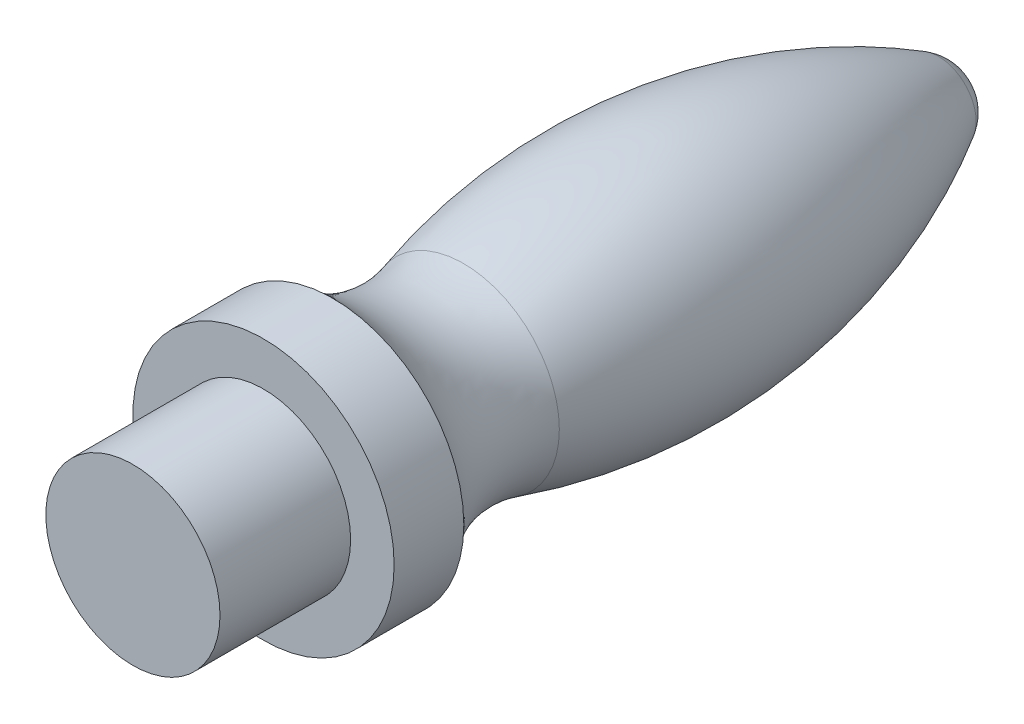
from build123d import *


with BuildPart() as part:
    # Sketch 1 → Revolve 1 (revolve)
    with BuildSketch(Plane(origin=(0, 0, 0), x_dir=(0, 0, -1), z_dir=(1, 0, 0)), mode=Mode.PRIVATE) as revolve_1_sk:
        with BuildLine():
            Line((-46.733653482, 0), (-46.733653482, 10))
            Line((-46.733653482, 10), (-31.733653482, 10))
            Line((-31.733653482, 10), (-31.733653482, 15))
            Line((-31.733653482, 15), (-23.733653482, 15))
            ThreePointArc((-23.733653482, 15), (-16.806867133, 10.919806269), (-8.768113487, 11.002206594))
            ThreePointArc((-8.768113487, 11.002206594), (19.184860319, 13.239603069), (45.772971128, 4.326295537))
            ThreePointArc((45.772971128, 4.326295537), (47.598385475, 2.496685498), (48.266346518, 0))
            Line((48.266346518, 0), (-46.733653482, 0))
        make_face()
    revolve(revolve_1_sk.sketch.rotate(Axis((0, 0, 68.412745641), (0, 0, -1)), 90), axis=Axis((0, 0, 68.412745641), (0, 0, -1)))


solid = part.part
